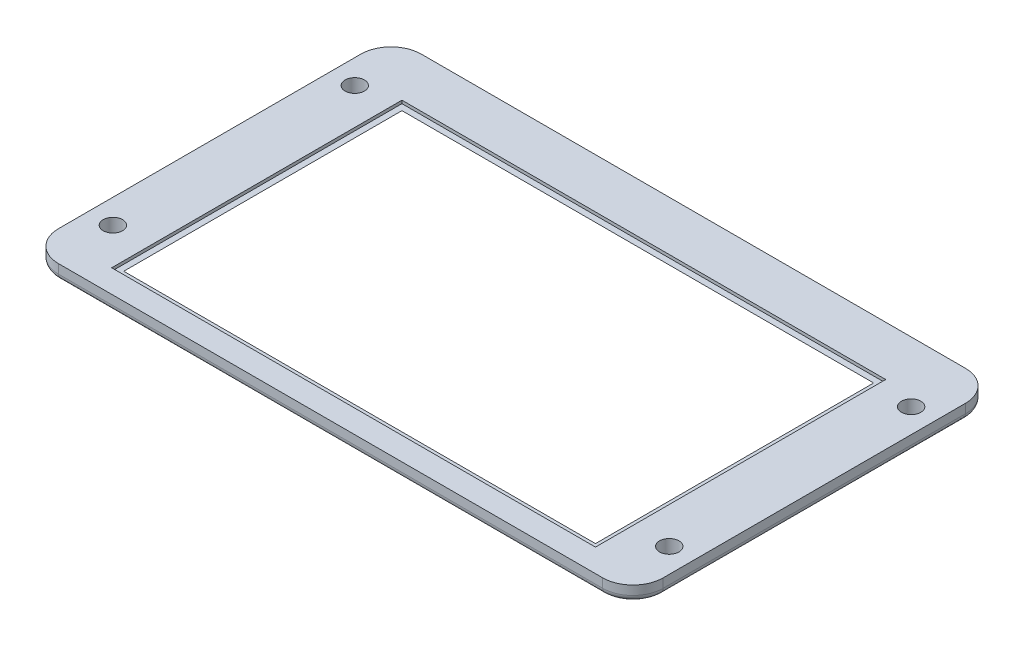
ISO-10303-21;
HEADER;
FILE_DESCRIPTION(('STEP AP214'),'2;1');
FILE_NAME('part.step','',(''),(''),'','','');
FILE_SCHEMA(('AUTOMOTIVE_DESIGN { 1 0 10303 214 1 1 1 1 }'));
ENDSEC;
DATA;
#1=APPLICATION_CONTEXT('core data for automotive mechanical design processes');
#2=APPLICATION_PROTOCOL_DEFINITION('international standard','automotive_design',2000,#1);
#3=PRODUCT_CONTEXT('',#1,'mechanical');
#4=PRODUCT('Part','Part','',(#3));
#5=PRODUCT_RELATED_PRODUCT_CATEGORY('part','',(#4));
#6=PRODUCT_DEFINITION_FORMATION('','',#4);
#7=PRODUCT_DEFINITION_CONTEXT('part definition',#1,'design');
#8=PRODUCT_DEFINITION('design','',#6,#7);
#9=PRODUCT_DEFINITION_SHAPE('','',#8);
#10=(LENGTH_UNIT() NAMED_UNIT(*) SI_UNIT(.MILLI.,.METRE.));
#11=(NAMED_UNIT(*) PLANE_ANGLE_UNIT() SI_UNIT($,.RADIAN.));
#12=(NAMED_UNIT(*) SI_UNIT($,.STERADIAN.) SOLID_ANGLE_UNIT());
#13=UNCERTAINTY_MEASURE_WITH_UNIT(LENGTH_MEASURE(1.E-05),#10,'distance_accuracy_value','');
#14=(GEOMETRIC_REPRESENTATION_CONTEXT(3) GLOBAL_UNCERTAINTY_ASSIGNED_CONTEXT((#13)) GLOBAL_UNIT_ASSIGNED_CONTEXT((#10,
#11,#12)) REPRESENTATION_CONTEXT('',''));
#15=CARTESIAN_POINT('',(0.,0.,0.));
#16=DIRECTION('',(0.,0.,1.));
#17=DIRECTION('',(1.,0.,0.));
#18=AXIS2_PLACEMENT_3D('',#15,#16,#17);
#19=CARTESIAN_POINT('',(0.,3.175,0.));
#20=DIRECTION('',(1.,0.,0.));
#21=DIRECTION('',(0.,0.,-1.));
#22=AXIS2_PLACEMENT_3D('',#19,#20,#21);
#23=PLANE('',#22);
#24=DIRECTION('',(0.,-1.,0.));
#25=VECTOR('',#24,1.);
#26=CARTESIAN_POINT('',(0.,3.175,-69.85));
#27=LINE('',#26,#25);
#28=CARTESIAN_POINT('',(0.,3.175,-69.85));
#29=VERTEX_POINT('',#28);
#30=CARTESIAN_POINT('',(0.,1.27,-69.85));
#31=VERTEX_POINT('',#30);
#32=EDGE_CURVE('E269',#29,#31,#27,.T.);
#33=ORIENTED_EDGE('',*,*,#32,.T.);
#34=DIRECTION('',(0.,0.,1.));
#35=VECTOR('',#34,1.);
#36=CARTESIAN_POINT('',(0.,1.27,-6.35));
#37=LINE('',#36,#35);
#38=CARTESIAN_POINT('',(0.,1.27,-6.35));
#39=VERTEX_POINT('',#38);
#40=EDGE_CURVE('E57',#31,#39,#37,.T.);
#41=ORIENTED_EDGE('',*,*,#40,.T.);
#42=DIRECTION('',(0.,-1.,0.));
#43=VECTOR('',#42,1.);
#44=CARTESIAN_POINT('',(0.,3.175,-6.35));
#45=LINE('',#44,#43);
#46=CARTESIAN_POINT('',(0.,3.175,-6.35));
#47=VERTEX_POINT('',#46);
#48=EDGE_CURVE('E271',#39,#47,#45,.F.);
#49=ORIENTED_EDGE('',*,*,#48,.T.);
#50=DIRECTION('',(0.,0.,1.));
#51=VECTOR('',#50,1.);
#52=CARTESIAN_POINT('',(0.,3.175,0.));
#53=LINE('',#52,#51);
#54=EDGE_CURVE('E238',#29,#47,#53,.T.);
#55=ORIENTED_EDGE('',*,*,#54,.F.);
#56=EDGE_LOOP('',(#33,#41,#49,#55));
#57=FACE_BOUND('',#56,.T.);
#58=ADVANCED_FACE('F33',(#57),#23,.F.);
#59=CARTESIAN_POINT('',(0.,3.175,0.));
#60=DIRECTION('',(0.,0.,-1.));
#61=DIRECTION('',(-1.,0.,0.));
#62=AXIS2_PLACEMENT_3D('',#59,#60,#61);
#63=PLANE('',#62);
#64=DIRECTION('',(0.,-1.,0.));
#65=VECTOR('',#64,1.);
#66=CARTESIAN_POINT('',(6.35,3.175,0.));
#67=LINE('',#66,#65);
#68=CARTESIAN_POINT('',(6.35,3.175,0.));
#69=VERTEX_POINT('',#68);
#70=CARTESIAN_POINT('',(6.35,1.27,0.));
#71=VERTEX_POINT('',#70);
#72=EDGE_CURVE('E257',#69,#71,#67,.T.);
#73=ORIENTED_EDGE('',*,*,#72,.T.);
#74=DIRECTION('',(1.,0.,0.));
#75=VECTOR('',#74,1.);
#76=CARTESIAN_POINT('',(120.65,1.27,0.));
#77=LINE('',#76,#75);
#78=CARTESIAN_POINT('',(120.65,1.27,0.));
#79=VERTEX_POINT('',#78);
#80=EDGE_CURVE('E11',#71,#79,#77,.T.);
#81=ORIENTED_EDGE('',*,*,#80,.T.);
#82=DIRECTION('',(0.,-1.,0.));
#83=VECTOR('',#82,1.);
#84=CARTESIAN_POINT('',(120.65,3.175,0.));
#85=LINE('',#84,#83);
#86=CARTESIAN_POINT('',(120.65,3.175,0.));
#87=VERTEX_POINT('',#86);
#88=EDGE_CURVE('E259',#79,#87,#85,.F.);
#89=ORIENTED_EDGE('',*,*,#88,.T.);
#90=DIRECTION('',(1.,0.,0.));
#91=VECTOR('',#90,1.);
#92=CARTESIAN_POINT('',(0.,3.175,0.));
#93=LINE('',#92,#91);
#94=EDGE_CURVE('E243',#69,#87,#93,.T.);
#95=ORIENTED_EDGE('',*,*,#94,.F.);
#96=EDGE_LOOP('',(#73,#81,#89,#95));
#97=FACE_BOUND('',#96,.T.);
#98=ADVANCED_FACE('F378',(#97),#63,.F.);
#99=CARTESIAN_POINT('',(127.,3.175,0.));
#100=DIRECTION('',(-1.,0.,0.));
#101=DIRECTION('',(0.,0.,1.));
#102=AXIS2_PLACEMENT_3D('',#99,#100,#101);
#103=PLANE('',#102);
#104=DIRECTION('',(0.,-1.,0.));
#105=VECTOR('',#104,1.);
#106=CARTESIAN_POINT('',(127.,3.175,-6.35));
#107=LINE('',#106,#105);
#108=CARTESIAN_POINT('',(127.,3.175,-6.35));
#109=VERTEX_POINT('',#108);
#110=CARTESIAN_POINT('',(127.,1.27,-6.35));
#111=VERTEX_POINT('',#110);
#112=EDGE_CURVE('E254',#109,#111,#107,.T.);
#113=ORIENTED_EDGE('',*,*,#112,.T.);
#114=DIRECTION('',(0.,0.,-1.));
#115=VECTOR('',#114,1.);
#116=CARTESIAN_POINT('',(127.,1.27,-69.85));
#117=LINE('',#116,#115);
#118=CARTESIAN_POINT('',(127.,1.27,-69.85));
#119=VERTEX_POINT('',#118);
#120=EDGE_CURVE('E324',#111,#119,#117,.T.);
#121=ORIENTED_EDGE('',*,*,#120,.T.);
#122=DIRECTION('',(0.,-1.,0.));
#123=VECTOR('',#122,1.);
#124=CARTESIAN_POINT('',(127.,3.175,-69.85));
#125=LINE('',#124,#123);
#126=CARTESIAN_POINT('',(127.,3.175,-69.85));
#127=VERTEX_POINT('',#126);
#128=EDGE_CURVE('E252',#119,#127,#125,.F.);
#129=ORIENTED_EDGE('',*,*,#128,.T.);
#130=DIRECTION('',(0.,0.,-1.));
#131=VECTOR('',#130,1.);
#132=CARTESIAN_POINT('',(127.,3.175,0.));
#133=LINE('',#132,#131);
#134=EDGE_CURVE('E246',#109,#127,#133,.T.);
#135=ORIENTED_EDGE('',*,*,#134,.F.);
#136=EDGE_LOOP('',(#113,#121,#129,#135));
#137=FACE_BOUND('',#136,.T.);
#138=ADVANCED_FACE('F400',(#137),#103,.F.);
#139=CARTESIAN_POINT('',(0.,3.175,-76.2));
#140=DIRECTION('',(0.,0.,1.));
#141=DIRECTION('',(1.,0.,0.));
#142=AXIS2_PLACEMENT_3D('',#139,#140,#141);
#143=PLANE('',#142);
#144=DIRECTION('',(0.,-1.,0.));
#145=VECTOR('',#144,1.);
#146=CARTESIAN_POINT('',(120.65,3.175,-76.2));
#147=LINE('',#146,#145);
#148=CARTESIAN_POINT('',(120.65,3.175,-76.2));
#149=VERTEX_POINT('',#148);
#150=CARTESIAN_POINT('',(120.65,1.27,-76.2));
#151=VERTEX_POINT('',#150);
#152=EDGE_CURVE('E275',#149,#151,#147,.T.);
#153=ORIENTED_EDGE('',*,*,#152,.T.);
#154=DIRECTION('',(-1.,0.,0.));
#155=VECTOR('',#154,1.);
#156=CARTESIAN_POINT('',(6.34999999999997,1.27,-76.2));
#157=LINE('',#156,#155);
#158=CARTESIAN_POINT('',(6.34999999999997,1.27,-76.2));
#159=VERTEX_POINT('',#158);
#160=EDGE_CURVE('E328',#151,#159,#157,.T.);
#161=ORIENTED_EDGE('',*,*,#160,.T.);
#162=DIRECTION('',(0.,-1.,0.));
#163=VECTOR('',#162,1.);
#164=CARTESIAN_POINT('',(6.34999999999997,3.175,-76.2));
#165=LINE('',#164,#163);
#166=CARTESIAN_POINT('',(6.34999999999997,3.175,-76.2));
#167=VERTEX_POINT('',#166);
#168=EDGE_CURVE('E273',#159,#167,#165,.F.);
#169=ORIENTED_EDGE('',*,*,#168,.T.);
#170=DIRECTION('',(-1.,0.,0.));
#171=VECTOR('',#170,1.);
#172=CARTESIAN_POINT('',(0.,3.175,-76.2));
#173=LINE('',#172,#171);
#174=EDGE_CURVE('E249',#149,#167,#173,.T.);
#175=ORIENTED_EDGE('',*,*,#174,.F.);
#176=EDGE_LOOP('',(#153,#161,#169,#175));
#177=FACE_BOUND('',#176,.T.);
#178=ADVANCED_FACE('F409',(#177),#143,.F.);
#179=CARTESIAN_POINT('',(0.,3.175,0.));
#180=DIRECTION('',(0.,-1.,0.));
#181=DIRECTION('',(0.,0.,-1.));
#182=AXIS2_PLACEMENT_3D('',#179,#180,#181);
#183=PLANE('',#182);
#184=DIRECTION('',(1.,0.,0.));
#185=VECTOR('',#184,1.);
#186=CARTESIAN_POINT('',(12.7,3.175,-4.82599999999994));
#187=LINE('',#186,#185);
#188=CARTESIAN_POINT('',(12.7,3.175,-4.82599999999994));
#189=VERTEX_POINT('',#188);
#190=CARTESIAN_POINT('',(114.3,3.175,-4.82599999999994));
#191=VERTEX_POINT('',#190);
#192=EDGE_CURVE('E205',#189,#191,#187,.T.);
#193=ORIENTED_EDGE('',*,*,#192,.F.);
#194=DIRECTION('',(0.,0.,1.));
#195=VECTOR('',#194,1.);
#196=CARTESIAN_POINT('',(12.7,3.175,-4.82599999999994));
#197=LINE('',#196,#195);
#198=CARTESIAN_POINT('',(12.7,3.175,-65.786));
#199=VERTEX_POINT('',#198);
#200=EDGE_CURVE('E179',#199,#189,#197,.T.);
#201=ORIENTED_EDGE('',*,*,#200,.F.);
#202=DIRECTION('',(-1.,0.,0.));
#203=VECTOR('',#202,1.);
#204=CARTESIAN_POINT('',(12.7,3.175,-65.786));
#205=LINE('',#204,#203);
#206=CARTESIAN_POINT('',(114.3,3.175,-65.786));
#207=VERTEX_POINT('',#206);
#208=EDGE_CURVE('E196',#207,#199,#205,.T.);
#209=ORIENTED_EDGE('',*,*,#208,.F.);
#210=DIRECTION('',(0.,0.,-1.));
#211=VECTOR('',#210,1.);
#212=CARTESIAN_POINT('',(114.3,3.175,-4.82599999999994));
#213=LINE('',#212,#211);
#214=EDGE_CURVE('E199',#191,#207,#213,.T.);
#215=ORIENTED_EDGE('',*,*,#214,.F.);
#216=EDGE_LOOP('',(#193,#201,#209,#215));
#217=FACE_BOUND('',#216,.T.);
#218=CARTESIAN_POINT('',(121.92,3.175,-12.7));
#219=DIRECTION('',(0.,1.,0.));
#220=DIRECTION('',(0.,0.,1.));
#221=AXIS2_PLACEMENT_3D('',#218,#219,#220);
#222=CIRCLE('',#221,2.03200000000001);
#223=CARTESIAN_POINT('',(121.92,3.175,-10.668));
#224=VERTEX_POINT('',#223);
#225=EDGE_CURVE('E219',#224,#224,#222,.T.);
#226=ORIENTED_EDGE('',*,*,#225,.F.);
#227=EDGE_LOOP('',(#226));
#228=FACE_BOUND('',#227,.T.);
#229=CARTESIAN_POINT('',(121.92,3.175,-63.5));
#230=DIRECTION('',(0.,1.,0.));
#231=DIRECTION('',(0.,0.,1.));
#232=AXIS2_PLACEMENT_3D('',#229,#230,#231);
#233=CIRCLE('',#232,2.03200000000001);
#234=CARTESIAN_POINT('',(121.92,3.175,-61.468));
#235=VERTEX_POINT('',#234);
#236=EDGE_CURVE('E218',#235,#235,#233,.T.);
#237=ORIENTED_EDGE('',*,*,#236,.F.);
#238=EDGE_LOOP('',(#237));
#239=FACE_BOUND('',#238,.T.);
#240=CARTESIAN_POINT('',(5.07999999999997,3.175,-12.7));
#241=DIRECTION('',(0.,1.,0.));
#242=DIRECTION('',(0.,0.,1.));
#243=AXIS2_PLACEMENT_3D('',#240,#241,#242);
#244=CIRCLE('',#243,2.032);
#245=CARTESIAN_POINT('',(5.07999999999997,3.175,-10.668));
#246=VERTEX_POINT('',#245);
#247=EDGE_CURVE('E226',#246,#246,#244,.T.);
#248=ORIENTED_EDGE('',*,*,#247,.F.);
#249=EDGE_LOOP('',(#248));
#250=FACE_BOUND('',#249,.T.);
#251=CARTESIAN_POINT('',(5.07999999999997,3.175,-63.5));
#252=DIRECTION('',(0.,1.,0.));
#253=DIRECTION('',(0.,0.,1.));
#254=AXIS2_PLACEMENT_3D('',#251,#252,#253);
#255=CIRCLE('',#254,2.032);
#256=CARTESIAN_POINT('',(5.07999999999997,3.175,-61.468));
#257=VERTEX_POINT('',#256);
#258=EDGE_CURVE('E232',#257,#257,#255,.T.);
#259=ORIENTED_EDGE('',*,*,#258,.F.);
#260=EDGE_LOOP('',(#259));
#261=FACE_BOUND('',#260,.T.);
#262=ORIENTED_EDGE('',*,*,#94,.T.);
#263=CARTESIAN_POINT('',(120.65,3.175,-6.35));
#264=DIRECTION('',(0.,-1.,0.));
#265=DIRECTION('',(0.,0.,-1.));
#266=AXIS2_PLACEMENT_3D('',#263,#264,#265);
#267=CIRCLE('',#266,6.35);
#268=EDGE_CURVE('E267',#87,#109,#267,.F.);
#269=ORIENTED_EDGE('',*,*,#268,.T.);
#270=ORIENTED_EDGE('',*,*,#134,.T.);
#271=CARTESIAN_POINT('',(120.65,3.175,-69.85));
#272=DIRECTION('',(0.,-1.,0.));
#273=DIRECTION('',(0.,0.,-1.));
#274=AXIS2_PLACEMENT_3D('',#271,#272,#273);
#275=CIRCLE('',#274,6.35);
#276=EDGE_CURVE('E263',#127,#149,#275,.F.);
#277=ORIENTED_EDGE('',*,*,#276,.T.);
#278=ORIENTED_EDGE('',*,*,#174,.T.);
#279=CARTESIAN_POINT('',(6.34999999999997,3.175,-69.85));
#280=DIRECTION('',(0.,-1.,0.));
#281=DIRECTION('',(0.,0.,-1.));
#282=AXIS2_PLACEMENT_3D('',#279,#280,#281);
#283=CIRCLE('',#282,6.35);
#284=EDGE_CURVE('E261',#167,#29,#283,.F.);
#285=ORIENTED_EDGE('',*,*,#284,.T.);
#286=ORIENTED_EDGE('',*,*,#54,.T.);
#287=CARTESIAN_POINT('',(6.35,3.175,-6.35));
#288=DIRECTION('',(0.,-1.,0.));
#289=DIRECTION('',(0.,0.,-1.));
#290=AXIS2_PLACEMENT_3D('',#287,#288,#289);
#291=CIRCLE('',#290,6.35);
#292=EDGE_CURVE('E265',#47,#69,#291,.F.);
#293=ORIENTED_EDGE('',*,*,#292,.T.);
#294=EDGE_LOOP('',(#262,#269,#270,#277,#278,#285,#286,#293));
#295=FACE_BOUND('',#294,.T.);
#296=ADVANCED_FACE('F372',(#217,#228,#239,#250,#261,#295),#183,.F.);
#297=CARTESIAN_POINT('',(0.,0.,0.));
#298=DIRECTION('',(0.,-1.,0.));
#299=DIRECTION('',(0.,0.,-1.));
#300=AXIS2_PLACEMENT_3D('',#297,#298,#299);
#301=PLANE('',#300);
#302=DIRECTION('',(0.,0.,-1.));
#303=VECTOR('',#302,1.);
#304=CARTESIAN_POINT('',(125.73,0.,-6.35));
#305=LINE('',#304,#303);
#306=CARTESIAN_POINT('',(125.73,0.,-69.85));
#307=VERTEX_POINT('',#306);
#308=CARTESIAN_POINT('',(125.73,0.,-6.35));
#309=VERTEX_POINT('',#308);
#310=EDGE_CURVE('E316',#307,#309,#305,.F.);
#311=ORIENTED_EDGE('',*,*,#310,.T.);
#312=CARTESIAN_POINT('',(120.65,0.,-6.35));
#313=DIRECTION('',(0.,-1.,0.));
#314=DIRECTION('',(0.,0.,-1.));
#315=AXIS2_PLACEMENT_3D('',#312,#313,#314);
#316=CIRCLE('',#315,5.08);
#317=CARTESIAN_POINT('',(120.65,0.,-1.27));
#318=VERTEX_POINT('',#317);
#319=EDGE_CURVE('E318',#309,#318,#316,.T.);
#320=ORIENTED_EDGE('',*,*,#319,.T.);
#321=DIRECTION('',(1.,0.,0.));
#322=VECTOR('',#321,1.);
#323=CARTESIAN_POINT('',(6.35,0.,-1.27));
#324=LINE('',#323,#322);
#325=CARTESIAN_POINT('',(6.35,0.,-1.27));
#326=VERTEX_POINT('',#325);
#327=EDGE_CURVE('E295',#318,#326,#324,.F.);
#328=ORIENTED_EDGE('',*,*,#327,.T.);
#329=CARTESIAN_POINT('',(6.35,0.,-6.35));
#330=DIRECTION('',(0.,-1.,0.));
#331=DIRECTION('',(0.,0.,-1.));
#332=AXIS2_PLACEMENT_3D('',#329,#330,#331);
#333=CIRCLE('',#332,5.08);
#334=CARTESIAN_POINT('',(1.27,0.,-6.35));
#335=VERTEX_POINT('',#334);
#336=EDGE_CURVE('E306',#326,#335,#333,.T.);
#337=ORIENTED_EDGE('',*,*,#336,.T.);
#338=DIRECTION('',(0.,0.,1.));
#339=VECTOR('',#338,1.);
#340=CARTESIAN_POINT('',(1.26999999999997,0.,-69.85));
#341=LINE('',#340,#339);
#342=CARTESIAN_POINT('',(1.26999999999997,0.,-69.85));
#343=VERTEX_POINT('',#342);
#344=EDGE_CURVE('E308',#335,#343,#341,.F.);
#345=ORIENTED_EDGE('',*,*,#344,.T.);
#346=CARTESIAN_POINT('',(6.34999999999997,0.,-69.85));
#347=DIRECTION('',(0.,-1.,0.));
#348=DIRECTION('',(0.,0.,-1.));
#349=AXIS2_PLACEMENT_3D('',#346,#347,#348);
#350=CIRCLE('',#349,5.08);
#351=CARTESIAN_POINT('',(6.34999999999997,0.,-74.93));
#352=VERTEX_POINT('',#351);
#353=EDGE_CURVE('E310',#343,#352,#350,.T.);
#354=ORIENTED_EDGE('',*,*,#353,.T.);
#355=DIRECTION('',(-1.,0.,0.));
#356=VECTOR('',#355,1.);
#357=CARTESIAN_POINT('',(120.65,0.,-74.93));
#358=LINE('',#357,#356);
#359=CARTESIAN_POINT('',(120.65,0.,-74.93));
#360=VERTEX_POINT('',#359);
#361=EDGE_CURVE('E312',#352,#360,#358,.F.);
#362=ORIENTED_EDGE('',*,*,#361,.T.);
#363=CARTESIAN_POINT('',(120.65,0.,-69.85));
#364=DIRECTION('',(0.,-1.,0.));
#365=DIRECTION('',(0.,0.,-1.));
#366=AXIS2_PLACEMENT_3D('',#363,#364,#365);
#367=CIRCLE('',#366,5.08);
#368=EDGE_CURVE('E314',#360,#307,#367,.T.);
#369=ORIENTED_EDGE('',*,*,#368,.T.);
#370=EDGE_LOOP('',(#311,#320,#328,#337,#345,#354,#362,#369));
#371=FACE_BOUND('',#370,.T.);
#372=DIRECTION('',(-1.,0.,0.));
#373=VECTOR('',#372,1.);
#374=CARTESIAN_POINT('',(13.97,0.,-67.056));
#375=LINE('',#374,#373);
#376=CARTESIAN_POINT('',(115.57,0.,-67.056));
#377=VERTEX_POINT('',#376);
#378=CARTESIAN_POINT('',(11.43,0.,-67.056));
#379=VERTEX_POINT('',#378);
#380=EDGE_CURVE('E278',#377,#379,#375,.T.);
#381=ORIENTED_EDGE('',*,*,#380,.T.);
#382=DIRECTION('',(0.,0.,1.));
#383=VECTOR('',#382,1.);
#384=CARTESIAN_POINT('',(11.43,0.,-6.096));
#385=LINE('',#384,#383);
#386=CARTESIAN_POINT('',(11.43,0.,-3.556));
#387=VERTEX_POINT('',#386);
#388=EDGE_CURVE('E284',#379,#387,#385,.T.);
#389=ORIENTED_EDGE('',*,*,#388,.T.);
#390=DIRECTION('',(1.,0.,0.));
#391=VECTOR('',#390,1.);
#392=CARTESIAN_POINT('',(113.03,0.,-3.556));
#393=LINE('',#392,#391);
#394=CARTESIAN_POINT('',(115.57,0.,-3.556));
#395=VERTEX_POINT('',#394);
#396=EDGE_CURVE('E282',#387,#395,#393,.T.);
#397=ORIENTED_EDGE('',*,*,#396,.T.);
#398=DIRECTION('',(0.,0.,-1.));
#399=VECTOR('',#398,1.);
#400=CARTESIAN_POINT('',(115.57,0.,-64.516));
#401=LINE('',#400,#399);
#402=EDGE_CURVE('E280',#395,#377,#401,.T.);
#403=ORIENTED_EDGE('',*,*,#402,.T.);
#404=EDGE_LOOP('',(#381,#389,#397,#403));
#405=FACE_BOUND('',#404,.T.);
#406=CARTESIAN_POINT('',(121.92,0.,-12.7));
#407=DIRECTION('',(0.,1.,0.));
#408=DIRECTION('',(0.,0.,1.));
#409=AXIS2_PLACEMENT_3D('',#406,#407,#408);
#410=CIRCLE('',#409,2.03200000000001);
#411=CARTESIAN_POINT('',(121.92,0.,-10.668));
#412=VERTEX_POINT('',#411);
#413=EDGE_CURVE('E215',#412,#412,#410,.T.);
#414=ORIENTED_EDGE('',*,*,#413,.T.);
#415=EDGE_LOOP('',(#414));
#416=FACE_BOUND('',#415,.T.);
#417=CARTESIAN_POINT('',(121.92,0.,-63.5));
#418=DIRECTION('',(0.,1.,0.));
#419=DIRECTION('',(0.,0.,1.));
#420=AXIS2_PLACEMENT_3D('',#417,#418,#419);
#421=CIRCLE('',#420,2.03200000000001);
#422=CARTESIAN_POINT('',(121.92,0.,-61.468));
#423=VERTEX_POINT('',#422);
#424=EDGE_CURVE('E223',#423,#423,#421,.T.);
#425=ORIENTED_EDGE('',*,*,#424,.T.);
#426=EDGE_LOOP('',(#425));
#427=FACE_BOUND('',#426,.T.);
#428=CARTESIAN_POINT('',(5.07999999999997,0.,-12.7));
#429=DIRECTION('',(0.,1.,0.));
#430=DIRECTION('',(0.,0.,1.));
#431=AXIS2_PLACEMENT_3D('',#428,#429,#430);
#432=CIRCLE('',#431,2.032);
#433=CARTESIAN_POINT('',(5.07999999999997,0.,-10.668));
#434=VERTEX_POINT('',#433);
#435=EDGE_CURVE('E229',#434,#434,#432,.T.);
#436=ORIENTED_EDGE('',*,*,#435,.T.);
#437=EDGE_LOOP('',(#436));
#438=FACE_BOUND('',#437,.T.);
#439=CARTESIAN_POINT('',(5.07999999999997,0.,-63.5));
#440=DIRECTION('',(0.,1.,0.));
#441=DIRECTION('',(0.,0.,1.));
#442=AXIS2_PLACEMENT_3D('',#439,#440,#441);
#443=CIRCLE('',#442,2.032);
#444=CARTESIAN_POINT('',(5.07999999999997,0.,-61.468));
#445=VERTEX_POINT('',#444);
#446=EDGE_CURVE('E235',#445,#445,#443,.T.);
#447=ORIENTED_EDGE('',*,*,#446,.T.);
#448=EDGE_LOOP('',(#447));
#449=FACE_BOUND('',#448,.T.);
#450=ADVANCED_FACE('F416',(#371,#405,#416,#427,#438,#449),#301,.T.);
#451=CARTESIAN_POINT('',(5.07999999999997,0.,-63.5));
#452=DIRECTION('',(0.,1.,0.));
#453=DIRECTION('',(0.,0.,1.));
#454=AXIS2_PLACEMENT_3D('',#451,#452,#453);
#455=CYLINDRICAL_SURFACE('',#454,2.032);
#456=ORIENTED_EDGE('',*,*,#446,.F.);
#457=EDGE_LOOP('',(#456));
#458=FACE_BOUND('',#457,.T.);
#459=ORIENTED_EDGE('',*,*,#258,.T.);
#460=EDGE_LOOP('',(#459));
#461=FACE_BOUND('',#460,.T.);
#462=ADVANCED_FACE('F503',(#458,#461),#455,.F.);
#463=CARTESIAN_POINT('',(5.07999999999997,0.,-12.7));
#464=DIRECTION('',(0.,1.,0.));
#465=DIRECTION('',(0.,0.,1.));
#466=AXIS2_PLACEMENT_3D('',#463,#464,#465);
#467=CYLINDRICAL_SURFACE('',#466,2.032);
#468=ORIENTED_EDGE('',*,*,#435,.F.);
#469=EDGE_LOOP('',(#468));
#470=FACE_BOUND('',#469,.T.);
#471=ORIENTED_EDGE('',*,*,#247,.T.);
#472=EDGE_LOOP('',(#471));
#473=FACE_BOUND('',#472,.T.);
#474=ADVANCED_FACE('F499',(#470,#473),#467,.F.);
#475=CARTESIAN_POINT('',(121.92,0.,-63.5));
#476=DIRECTION('',(0.,1.,0.));
#477=DIRECTION('',(0.,0.,1.));
#478=AXIS2_PLACEMENT_3D('',#475,#476,#477);
#479=CYLINDRICAL_SURFACE('',#478,2.03200000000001);
#480=ORIENTED_EDGE('',*,*,#424,.F.);
#481=EDGE_LOOP('',(#480));
#482=FACE_BOUND('',#481,.T.);
#483=ORIENTED_EDGE('',*,*,#236,.T.);
#484=EDGE_LOOP('',(#483));
#485=FACE_BOUND('',#484,.T.);
#486=ADVANCED_FACE('F495',(#482,#485),#479,.F.);
#487=CARTESIAN_POINT('',(121.92,0.,-12.7));
#488=DIRECTION('',(0.,1.,0.));
#489=DIRECTION('',(0.,0.,1.));
#490=AXIS2_PLACEMENT_3D('',#487,#488,#489);
#491=CYLINDRICAL_SURFACE('',#490,2.03200000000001);
#492=ORIENTED_EDGE('',*,*,#413,.F.);
#493=EDGE_LOOP('',(#492));
#494=FACE_BOUND('',#493,.T.);
#495=ORIENTED_EDGE('',*,*,#225,.T.);
#496=EDGE_LOOP('',(#495));
#497=FACE_BOUND('',#496,.T.);
#498=ADVANCED_FACE('F430',(#494,#497),#491,.F.);
#499=CARTESIAN_POINT('',(120.65,3.175,-6.35));
#500=DIRECTION('',(0.,-1.,0.));
#501=DIRECTION('',(0.,0.,-1.));
#502=AXIS2_PLACEMENT_3D('',#499,#500,#501);
#503=CYLINDRICAL_SURFACE('',#502,6.35);
#504=ORIENTED_EDGE('',*,*,#88,.F.);
#505=CARTESIAN_POINT('',(120.65,1.27,-6.35));
#506=DIRECTION('',(0.,-1.,0.));
#507=DIRECTION('',(0.,0.,-1.));
#508=AXIS2_PLACEMENT_3D('',#505,#506,#507);
#509=CIRCLE('',#508,6.35);
#510=EDGE_CURVE('E321',#79,#111,#509,.F.);
#511=ORIENTED_EDGE('',*,*,#510,.T.);
#512=ORIENTED_EDGE('',*,*,#112,.F.);
#513=ORIENTED_EDGE('',*,*,#268,.F.);
#514=EDGE_LOOP('',(#504,#511,#512,#513));
#515=FACE_BOUND('',#514,.T.);
#516=ADVANCED_FACE('F396',(#515),#503,.T.);
#517=CARTESIAN_POINT('',(6.35,3.175,-6.35));
#518=DIRECTION('',(0.,-1.,0.));
#519=DIRECTION('',(0.,0.,-1.));
#520=AXIS2_PLACEMENT_3D('',#517,#518,#519);
#521=CYLINDRICAL_SURFACE('',#520,6.35);
#522=ORIENTED_EDGE('',*,*,#48,.F.);
#523=CARTESIAN_POINT('',(6.35,1.27,-6.35));
#524=DIRECTION('',(0.,-1.,0.));
#525=DIRECTION('',(0.,0.,-1.));
#526=AXIS2_PLACEMENT_3D('',#523,#524,#525);
#527=CIRCLE('',#526,6.35);
#528=EDGE_CURVE('E42',#39,#71,#527,.F.);
#529=ORIENTED_EDGE('',*,*,#528,.T.);
#530=ORIENTED_EDGE('',*,*,#72,.F.);
#531=ORIENTED_EDGE('',*,*,#292,.F.);
#532=EDGE_LOOP('',(#522,#529,#530,#531));
#533=FACE_BOUND('',#532,.T.);
#534=ADVANCED_FACE('F374',(#533),#521,.T.);
#535=CARTESIAN_POINT('',(120.65,3.175,-69.85));
#536=DIRECTION('',(0.,-1.,0.));
#537=DIRECTION('',(0.,0.,-1.));
#538=AXIS2_PLACEMENT_3D('',#535,#536,#537);
#539=CYLINDRICAL_SURFACE('',#538,6.35);
#540=ORIENTED_EDGE('',*,*,#128,.F.);
#541=CARTESIAN_POINT('',(120.65,1.27,-69.85));
#542=DIRECTION('',(0.,-1.,0.));
#543=DIRECTION('',(0.,0.,-1.));
#544=AXIS2_PLACEMENT_3D('',#541,#542,#543);
#545=CIRCLE('',#544,6.35);
#546=EDGE_CURVE('E326',#119,#151,#545,.F.);
#547=ORIENTED_EDGE('',*,*,#546,.T.);
#548=ORIENTED_EDGE('',*,*,#152,.F.);
#549=ORIENTED_EDGE('',*,*,#276,.F.);
#550=EDGE_LOOP('',(#540,#547,#548,#549));
#551=FACE_BOUND('',#550,.T.);
#552=ADVANCED_FACE('F406',(#551),#539,.T.);
#553=CARTESIAN_POINT('',(6.34999999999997,3.175,-69.85));
#554=DIRECTION('',(0.,-1.,0.));
#555=DIRECTION('',(0.,0.,-1.));
#556=AXIS2_PLACEMENT_3D('',#553,#554,#555);
#557=CYLINDRICAL_SURFACE('',#556,6.35);
#558=ORIENTED_EDGE('',*,*,#168,.F.);
#559=CARTESIAN_POINT('',(6.34999999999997,1.27,-69.85));
#560=DIRECTION('',(0.,-1.,0.));
#561=DIRECTION('',(0.,0.,-1.));
#562=AXIS2_PLACEMENT_3D('',#559,#560,#561);
#563=CIRCLE('',#562,6.35);
#564=EDGE_CURVE('E330',#159,#31,#563,.F.);
#565=ORIENTED_EDGE('',*,*,#564,.T.);
#566=ORIENTED_EDGE('',*,*,#32,.F.);
#567=ORIENTED_EDGE('',*,*,#284,.F.);
#568=EDGE_LOOP('',(#558,#565,#566,#567));
#569=FACE_BOUND('',#568,.T.);
#570=ADVANCED_FACE('F367',(#569),#557,.T.);
#571=CARTESIAN_POINT('',(115.57,0.,0.));
#572=DIRECTION('',(-0.70710678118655,-0.707106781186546,0.));
#573=DIRECTION('',(0.,0.,1.));
#574=AXIS2_PLACEMENT_3D('',#571,#572,#573);
#575=PLANE('',#574);
#576=DIRECTION('',(-0.577350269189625,0.577350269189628,-0.577350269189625));
#577=VECTOR('',#576,1.);
#578=CARTESIAN_POINT('',(77.0466666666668,38.5233333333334,-42.0793333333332));
#579=LINE('',#578,#577);
#580=CARTESIAN_POINT('',(113.03,2.54,-6.09599999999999));
#581=VERTEX_POINT('',#580);
#582=EDGE_CURVE('E300',#581,#395,#579,.F.);
#583=ORIENTED_EDGE('',*,*,#582,.F.);
#584=DIRECTION('',(0.,0.,1.));
#585=VECTOR('',#584,1.);
#586=CARTESIAN_POINT('',(113.03,2.54000000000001,-6.096));
#587=LINE('',#586,#585);
#588=CARTESIAN_POINT('',(113.03,2.54,-64.516));
#589=VERTEX_POINT('',#588);
#590=EDGE_CURVE('E291',#589,#581,#587,.T.);
#591=ORIENTED_EDGE('',*,*,#590,.F.);
#592=DIRECTION('',(-0.577350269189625,0.577350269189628,0.577350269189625));
#593=VECTOR('',#592,1.);
#594=CARTESIAN_POINT('',(93.2180000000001,22.352,-44.7040000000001));
#595=LINE('',#594,#593);
#596=EDGE_CURVE('E222',#377,#589,#595,.T.);
#597=ORIENTED_EDGE('',*,*,#596,.F.);
#598=ORIENTED_EDGE('',*,*,#402,.F.);
#599=EDGE_LOOP('',(#583,#591,#597,#598));
#600=FACE_BOUND('',#599,.T.);
#601=ADVANCED_FACE('F437',(#600),#575,.T.);
#602=CARTESIAN_POINT('',(0.,0.,-67.056));
#603=DIRECTION('',(0.,-0.707106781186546,0.70710678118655));
#604=DIRECTION('',(1.,0.,0.));
#605=AXIS2_PLACEMENT_3D('',#602,#603,#604);
#606=PLANE('',#605);
#607=ORIENTED_EDGE('',*,*,#596,.T.);
#608=DIRECTION('',(1.,0.,0.));
#609=VECTOR('',#608,1.);
#610=CARTESIAN_POINT('',(113.03,2.54000000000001,-64.516));
#611=LINE('',#610,#609);
#612=CARTESIAN_POINT('',(13.97,2.54,-64.516));
#613=VERTEX_POINT('',#612);
#614=EDGE_CURVE('E293',#613,#589,#611,.T.);
#615=ORIENTED_EDGE('',*,*,#614,.F.);
#616=DIRECTION('',(-0.577350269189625,-0.577350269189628,-0.577350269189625));
#617=VECTOR('',#616,1.);
#618=CARTESIAN_POINT('',(33.7819999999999,22.352,-44.7040000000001));
#619=LINE('',#618,#617);
#620=EDGE_CURVE('E297',#379,#613,#619,.F.);
#621=ORIENTED_EDGE('',*,*,#620,.F.);
#622=ORIENTED_EDGE('',*,*,#380,.F.);
#623=EDGE_LOOP('',(#607,#615,#621,#622));
#624=FACE_BOUND('',#623,.T.);
#625=ADVANCED_FACE('F445',(#624),#606,.T.);
#626=CARTESIAN_POINT('',(0.,0.,-3.556));
#627=DIRECTION('',(0.,-0.707106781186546,-0.70710678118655));
#628=DIRECTION('',(-1.,0.,0.));
#629=AXIS2_PLACEMENT_3D('',#626,#627,#628);
#630=PLANE('',#629);
#631=ORIENTED_EDGE('',*,*,#582,.T.);
#632=ORIENTED_EDGE('',*,*,#396,.F.);
#633=DIRECTION('',(0.577350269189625,0.577350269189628,-0.577350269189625));
#634=VECTOR('',#633,1.);
#635=CARTESIAN_POINT('',(10.2446666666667,-1.18533333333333,-2.37066666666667));
#636=LINE('',#635,#634);
#637=CARTESIAN_POINT('',(13.97,2.54000000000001,-6.096));
#638=VERTEX_POINT('',#637);
#639=EDGE_CURVE('E211',#638,#387,#636,.F.);
#640=ORIENTED_EDGE('',*,*,#639,.F.);
#641=DIRECTION('',(-1.,0.,0.));
#642=VECTOR('',#641,1.);
#643=CARTESIAN_POINT('',(13.97,2.54000000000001,-6.096));
#644=LINE('',#643,#642);
#645=EDGE_CURVE('E289',#581,#638,#644,.T.);
#646=ORIENTED_EDGE('',*,*,#645,.F.);
#647=EDGE_LOOP('',(#631,#632,#640,#646));
#648=FACE_BOUND('',#647,.T.);
#649=ADVANCED_FACE('F441',(#648),#630,.T.);
#650=CARTESIAN_POINT('',(11.43,0.,0.));
#651=DIRECTION('',(0.70710678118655,-0.707106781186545,0.));
#652=DIRECTION('',(0.,0.,-1.));
#653=AXIS2_PLACEMENT_3D('',#650,#651,#652);
#654=PLANE('',#653);
#655=ORIENTED_EDGE('',*,*,#620,.T.);
#656=DIRECTION('',(0.,0.,-1.));
#657=VECTOR('',#656,1.);
#658=CARTESIAN_POINT('',(13.97,2.54000000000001,-64.516));
#659=LINE('',#658,#657);
#660=EDGE_CURVE('E287',#638,#613,#659,.T.);
#661=ORIENTED_EDGE('',*,*,#660,.F.);
#662=ORIENTED_EDGE('',*,*,#639,.T.);
#663=ORIENTED_EDGE('',*,*,#388,.F.);
#664=EDGE_LOOP('',(#655,#661,#662,#663));
#665=FACE_BOUND('',#664,.T.);
#666=ADVANCED_FACE('F438',(#665),#654,.T.);
#667=CARTESIAN_POINT('',(12.7,2.54,-4.82599999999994));
#668=DIRECTION('',(-1.,0.,0.));
#669=DIRECTION('',(0.,0.,1.));
#670=AXIS2_PLACEMENT_3D('',#667,#668,#669);
#671=PLANE('',#670);
#672=ORIENTED_EDGE('',*,*,#200,.T.);
#673=DIRECTION('',(0.,1.,0.));
#674=VECTOR('',#673,1.);
#675=CARTESIAN_POINT('',(12.7,2.54,-4.82599999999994));
#676=LINE('',#675,#674);
#677=CARTESIAN_POINT('',(12.7,2.54,-4.82599999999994));
#678=VERTEX_POINT('',#677);
#679=EDGE_CURVE('E172',#678,#189,#676,.T.);
#680=ORIENTED_EDGE('',*,*,#679,.F.);
#681=DIRECTION('',(0.,0.,1.));
#682=VECTOR('',#681,1.);
#683=CARTESIAN_POINT('',(12.7,2.54,-4.82599999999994));
#684=LINE('',#683,#682);
#685=CARTESIAN_POINT('',(12.7,2.54,-65.786));
#686=VERTEX_POINT('',#685);
#687=EDGE_CURVE('E176',#686,#678,#684,.T.);
#688=ORIENTED_EDGE('',*,*,#687,.F.);
#689=DIRECTION('',(0.,1.,0.));
#690=VECTOR('',#689,1.);
#691=CARTESIAN_POINT('',(12.7,2.54,-65.786));
#692=LINE('',#691,#690);
#693=EDGE_CURVE('E209',#686,#199,#692,.T.);
#694=ORIENTED_EDGE('',*,*,#693,.T.);
#695=EDGE_LOOP('',(#672,#680,#688,#694));
#696=FACE_BOUND('',#695,.T.);
#697=ADVANCED_FACE('F174',(#696),#671,.F.);
#698=CARTESIAN_POINT('',(12.7,2.54,-65.786));
#699=DIRECTION('',(0.,0.,-1.));
#700=DIRECTION('',(-1.,0.,0.));
#701=AXIS2_PLACEMENT_3D('',#698,#699,#700);
#702=PLANE('',#701);
#703=ORIENTED_EDGE('',*,*,#208,.T.);
#704=ORIENTED_EDGE('',*,*,#693,.F.);
#705=DIRECTION('',(-1.,0.,0.));
#706=VECTOR('',#705,1.);
#707=CARTESIAN_POINT('',(12.7,2.54,-65.786));
#708=LINE('',#707,#706);
#709=CARTESIAN_POINT('',(114.3,2.54,-65.786));
#710=VERTEX_POINT('',#709);
#711=EDGE_CURVE('E184',#710,#686,#708,.T.);
#712=ORIENTED_EDGE('',*,*,#711,.F.);
#713=DIRECTION('',(0.,1.,0.));
#714=VECTOR('',#713,1.);
#715=CARTESIAN_POINT('',(114.3,2.54,-65.786));
#716=LINE('',#715,#714);
#717=EDGE_CURVE('E212',#710,#207,#716,.T.);
#718=ORIENTED_EDGE('',*,*,#717,.T.);
#719=EDGE_LOOP('',(#703,#704,#712,#718));
#720=FACE_BOUND('',#719,.T.);
#721=ADVANCED_FACE('F484',(#720),#702,.F.);
#722=CARTESIAN_POINT('',(114.3,2.54,-4.82599999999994));
#723=DIRECTION('',(1.,0.,0.));
#724=DIRECTION('',(0.,0.,-1.));
#725=AXIS2_PLACEMENT_3D('',#722,#723,#724);
#726=PLANE('',#725);
#727=ORIENTED_EDGE('',*,*,#214,.T.);
#728=ORIENTED_EDGE('',*,*,#717,.F.);
#729=DIRECTION('',(0.,0.,-1.));
#730=VECTOR('',#729,1.);
#731=CARTESIAN_POINT('',(114.3,2.54,-4.82599999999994));
#732=LINE('',#731,#730);
#733=CARTESIAN_POINT('',(114.3,2.54,-4.82599999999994));
#734=VERTEX_POINT('',#733);
#735=EDGE_CURVE('E192',#734,#710,#732,.T.);
#736=ORIENTED_EDGE('',*,*,#735,.F.);
#737=DIRECTION('',(0.,1.,0.));
#738=VECTOR('',#737,1.);
#739=CARTESIAN_POINT('',(114.3,2.54,-4.82599999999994));
#740=LINE('',#739,#738);
#741=EDGE_CURVE('E183',#734,#191,#740,.T.);
#742=ORIENTED_EDGE('',*,*,#741,.T.);
#743=EDGE_LOOP('',(#727,#728,#736,#742));
#744=FACE_BOUND('',#743,.T.);
#745=ADVANCED_FACE('F481',(#744),#726,.F.);
#746=CARTESIAN_POINT('',(12.7,2.54,-4.82599999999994));
#747=DIRECTION('',(0.,0.,1.));
#748=DIRECTION('',(1.,0.,0.));
#749=AXIS2_PLACEMENT_3D('',#746,#747,#748);
#750=PLANE('',#749);
#751=ORIENTED_EDGE('',*,*,#192,.T.);
#752=ORIENTED_EDGE('',*,*,#741,.F.);
#753=DIRECTION('',(1.,0.,0.));
#754=VECTOR('',#753,1.);
#755=CARTESIAN_POINT('',(12.7,2.54,-4.82599999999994));
#756=LINE('',#755,#754);
#757=EDGE_CURVE('E187',#678,#734,#756,.T.);
#758=ORIENTED_EDGE('',*,*,#757,.F.);
#759=ORIENTED_EDGE('',*,*,#679,.T.);
#760=EDGE_LOOP('',(#751,#752,#758,#759));
#761=FACE_BOUND('',#760,.T.);
#762=ADVANCED_FACE('F188',(#761),#750,.F.);
#763=CARTESIAN_POINT('',(0.,2.54,0.));
#764=DIRECTION('',(0.,-1.,0.));
#765=DIRECTION('',(0.,0.,-1.));
#766=AXIS2_PLACEMENT_3D('',#763,#764,#765);
#767=PLANE('',#766);
#768=ORIENTED_EDGE('',*,*,#590,.T.);
#769=ORIENTED_EDGE('',*,*,#645,.T.);
#770=ORIENTED_EDGE('',*,*,#660,.T.);
#771=ORIENTED_EDGE('',*,*,#614,.T.);
#772=EDGE_LOOP('',(#768,#769,#770,#771));
#773=FACE_BOUND('',#772,.T.);
#774=ORIENTED_EDGE('',*,*,#687,.T.);
#775=ORIENTED_EDGE('',*,*,#757,.T.);
#776=ORIENTED_EDGE('',*,*,#735,.T.);
#777=ORIENTED_EDGE('',*,*,#711,.T.);
#778=EDGE_LOOP('',(#774,#775,#776,#777));
#779=FACE_BOUND('',#778,.T.);
#780=ADVANCED_FACE('F194',(#773,#779),#767,.F.);
#781=CARTESIAN_POINT('',(6.34999999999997,1.27,-69.85));
#782=DIRECTION('',(0.,-1.,0.));
#783=DIRECTION('',(0.,0.,-1.));
#784=AXIS2_PLACEMENT_3D('',#781,#782,#783);
#785=TOROIDAL_SURFACE('',#784,5.08,1.27);
#786=CARTESIAN_POINT('',(1.26999999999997,1.27,-69.85));
#787=DIRECTION('',(0.,0.,1.));
#788=DIRECTION('',(1.,0.,0.));
#789=AXIS2_PLACEMENT_3D('',#786,#787,#788);
#790=CIRCLE('',#789,1.27);
#791=EDGE_CURVE('E349',#31,#343,#790,.T.);
#792=ORIENTED_EDGE('',*,*,#791,.F.);
#793=ORIENTED_EDGE('',*,*,#564,.F.);
#794=CARTESIAN_POINT('',(6.34999999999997,1.27,-74.93));
#795=DIRECTION('',(1.,0.,0.));
#796=DIRECTION('',(0.,0.,-1.));
#797=AXIS2_PLACEMENT_3D('',#794,#795,#796);
#798=CIRCLE('',#797,1.27);
#799=EDGE_CURVE('E37',#352,#159,#798,.T.);
#800=ORIENTED_EDGE('',*,*,#799,.F.);
#801=ORIENTED_EDGE('',*,*,#353,.F.);
#802=EDGE_LOOP('',(#792,#793,#800,#801));
#803=FACE_BOUND('',#802,.T.);
#804=ADVANCED_FACE('F35',(#803),#785,.T.);
#805=CARTESIAN_POINT('',(0.,1.27,-74.93));
#806=DIRECTION('',(1.,0.,0.));
#807=DIRECTION('',(0.,0.,-1.));
#808=AXIS2_PLACEMENT_3D('',#805,#806,#807);
#809=CYLINDRICAL_SURFACE('',#808,1.27);
#810=ORIENTED_EDGE('',*,*,#799,.T.);
#811=ORIENTED_EDGE('',*,*,#160,.F.);
#812=CARTESIAN_POINT('',(120.65,1.27,-74.93));
#813=DIRECTION('',(1.,0.,0.));
#814=DIRECTION('',(0.,0.,-1.));
#815=AXIS2_PLACEMENT_3D('',#812,#813,#814);
#816=CIRCLE('',#815,1.27);
#817=EDGE_CURVE('E347',#360,#151,#816,.T.);
#818=ORIENTED_EDGE('',*,*,#817,.F.);
#819=ORIENTED_EDGE('',*,*,#361,.F.);
#820=EDGE_LOOP('',(#810,#811,#818,#819));
#821=FACE_BOUND('',#820,.T.);
#822=ADVANCED_FACE('F359',(#821),#809,.T.);
#823=CARTESIAN_POINT('',(1.27,1.27,0.));
#824=DIRECTION('',(0.,0.,-1.));
#825=DIRECTION('',(-1.,0.,0.));
#826=AXIS2_PLACEMENT_3D('',#823,#824,#825);
#827=CYLINDRICAL_SURFACE('',#826,1.27);
#828=ORIENTED_EDGE('',*,*,#791,.T.);
#829=ORIENTED_EDGE('',*,*,#344,.F.);
#830=CARTESIAN_POINT('',(1.27,1.27,-6.35));
#831=DIRECTION('',(0.,0.,1.));
#832=DIRECTION('',(1.,0.,0.));
#833=AXIS2_PLACEMENT_3D('',#830,#831,#832);
#834=CIRCLE('',#833,1.27);
#835=EDGE_CURVE('E344',#39,#335,#834,.T.);
#836=ORIENTED_EDGE('',*,*,#835,.F.);
#837=ORIENTED_EDGE('',*,*,#40,.F.);
#838=EDGE_LOOP('',(#828,#829,#836,#837));
#839=FACE_BOUND('',#838,.T.);
#840=ADVANCED_FACE('F466',(#839),#827,.T.);
#841=CARTESIAN_POINT('',(120.65,1.27,-69.85));
#842=DIRECTION('',(0.,-1.,0.));
#843=DIRECTION('',(0.,0.,-1.));
#844=AXIS2_PLACEMENT_3D('',#841,#842,#843);
#845=TOROIDAL_SURFACE('',#844,5.08,1.27);
#846=ORIENTED_EDGE('',*,*,#817,.T.);
#847=ORIENTED_EDGE('',*,*,#546,.F.);
#848=CARTESIAN_POINT('',(125.73,1.27,-69.85));
#849=DIRECTION('',(0.,0.,1.));
#850=DIRECTION('',(1.,0.,0.));
#851=AXIS2_PLACEMENT_3D('',#848,#849,#850);
#852=CIRCLE('',#851,1.27);
#853=EDGE_CURVE('E341',#307,#119,#852,.T.);
#854=ORIENTED_EDGE('',*,*,#853,.F.);
#855=ORIENTED_EDGE('',*,*,#368,.F.);
#856=EDGE_LOOP('',(#846,#847,#854,#855));
#857=FACE_BOUND('',#856,.T.);
#858=ADVANCED_FACE('F463',(#857),#845,.T.);
#859=CARTESIAN_POINT('',(6.35,1.27,-6.35));
#860=DIRECTION('',(0.,-1.,0.));
#861=DIRECTION('',(0.,0.,-1.));
#862=AXIS2_PLACEMENT_3D('',#859,#860,#861);
#863=TOROIDAL_SURFACE('',#862,5.08,1.27);
#864=ORIENTED_EDGE('',*,*,#835,.T.);
#865=ORIENTED_EDGE('',*,*,#336,.F.);
#866=CARTESIAN_POINT('',(6.35,1.27,-1.27));
#867=DIRECTION('',(1.,0.,0.));
#868=DIRECTION('',(0.,0.,-1.));
#869=AXIS2_PLACEMENT_3D('',#866,#867,#868);
#870=CIRCLE('',#869,1.27);
#871=EDGE_CURVE('E338',#71,#326,#870,.T.);
#872=ORIENTED_EDGE('',*,*,#871,.F.);
#873=ORIENTED_EDGE('',*,*,#528,.F.);
#874=EDGE_LOOP('',(#864,#865,#872,#873));
#875=FACE_BOUND('',#874,.T.);
#876=ADVANCED_FACE('F383',(#875),#863,.T.);
#877=CARTESIAN_POINT('',(125.73,1.27,0.));
#878=DIRECTION('',(0.,0.,1.));
#879=DIRECTION('',(1.,0.,0.));
#880=AXIS2_PLACEMENT_3D('',#877,#878,#879);
#881=CYLINDRICAL_SURFACE('',#880,1.27);
#882=ORIENTED_EDGE('',*,*,#853,.T.);
#883=ORIENTED_EDGE('',*,*,#120,.F.);
#884=CARTESIAN_POINT('',(125.73,1.27,-6.35));
#885=DIRECTION('',(0.,0.,1.));
#886=DIRECTION('',(1.,0.,0.));
#887=AXIS2_PLACEMENT_3D('',#884,#885,#886);
#888=CIRCLE('',#887,1.27);
#889=EDGE_CURVE('E336',#309,#111,#888,.T.);
#890=ORIENTED_EDGE('',*,*,#889,.F.);
#891=ORIENTED_EDGE('',*,*,#310,.F.);
#892=EDGE_LOOP('',(#882,#883,#890,#891));
#893=FACE_BOUND('',#892,.T.);
#894=ADVANCED_FACE('F457',(#893),#881,.T.);
#895=CARTESIAN_POINT('',(0.,1.27,-1.27));
#896=DIRECTION('',(-1.,0.,0.));
#897=DIRECTION('',(0.,0.,1.));
#898=AXIS2_PLACEMENT_3D('',#895,#896,#897);
#899=CYLINDRICAL_SURFACE('',#898,1.27);
#900=ORIENTED_EDGE('',*,*,#871,.T.);
#901=ORIENTED_EDGE('',*,*,#327,.F.);
#902=CARTESIAN_POINT('',(120.65,1.27,-1.27));
#903=DIRECTION('',(1.,0.,0.));
#904=DIRECTION('',(0.,0.,-1.));
#905=AXIS2_PLACEMENT_3D('',#902,#903,#904);
#906=CIRCLE('',#905,1.27);
#907=EDGE_CURVE('E334',#79,#318,#906,.T.);
#908=ORIENTED_EDGE('',*,*,#907,.F.);
#909=ORIENTED_EDGE('',*,*,#80,.F.);
#910=EDGE_LOOP('',(#900,#901,#908,#909));
#911=FACE_BOUND('',#910,.T.);
#912=ADVANCED_FACE('F387',(#911),#899,.T.);
#913=CARTESIAN_POINT('',(120.65,1.27,-6.35));
#914=DIRECTION('',(0.,-1.,0.));
#915=DIRECTION('',(0.,0.,-1.));
#916=AXIS2_PLACEMENT_3D('',#913,#914,#915);
#917=TOROIDAL_SURFACE('',#916,5.08,1.27);
#918=ORIENTED_EDGE('',*,*,#889,.T.);
#919=ORIENTED_EDGE('',*,*,#510,.F.);
#920=ORIENTED_EDGE('',*,*,#907,.T.);
#921=ORIENTED_EDGE('',*,*,#319,.F.);
#922=EDGE_LOOP('',(#918,#919,#920,#921));
#923=FACE_BOUND('',#922,.T.);
#924=ADVANCED_FACE('F391',(#923),#917,.T.);
#925=CLOSED_SHELL('',(#58,#98,#138,#178,#296,#450,#462,#474,#486,#498,#516,#534,#552,#570,#601,
#625,#649,#666,#697,#721,#745,#762,#780,#804,#822,#840,#858,#876,#894,#912,#924));
#926=MANIFOLD_SOLID_BREP('B2',#925);
#927=ADVANCED_BREP_SHAPE_REPRESENTATION('',(#18,#926),#14);
#928=SHAPE_DEFINITION_REPRESENTATION(#9,#927);
ENDSEC;
END-ISO-10303-21;
